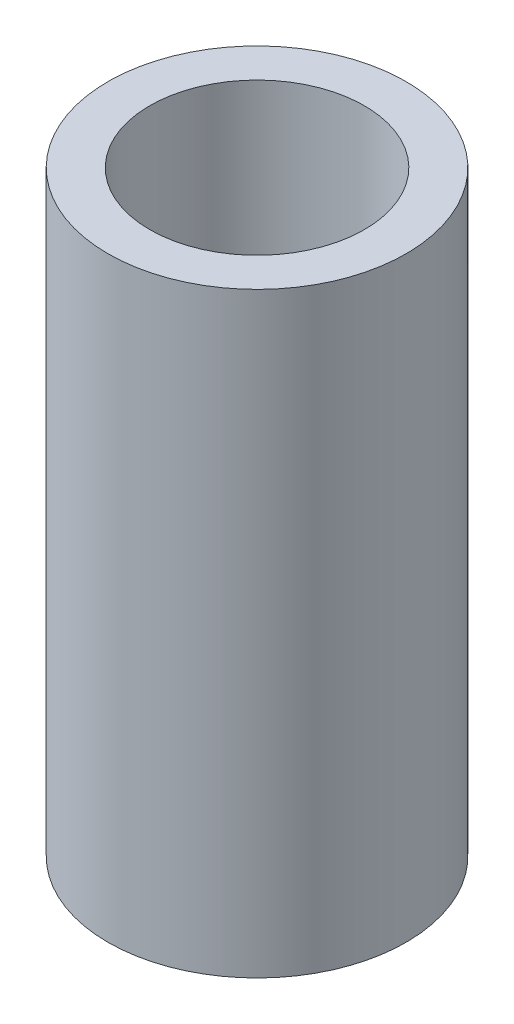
ISO-10303-21;
HEADER;
FILE_DESCRIPTION(('STEP AP214'),'2;1');
FILE_NAME('part.step','',(''),(''),'','','');
FILE_SCHEMA(('AUTOMOTIVE_DESIGN { 1 0 10303 214 1 1 1 1 }'));
ENDSEC;
DATA;
#1=APPLICATION_CONTEXT('core data for automotive mechanical design processes');
#2=APPLICATION_PROTOCOL_DEFINITION('international standard','automotive_design',2000,#1);
#3=PRODUCT_CONTEXT('',#1,'mechanical');
#4=PRODUCT('Part','Part','',(#3));
#5=PRODUCT_RELATED_PRODUCT_CATEGORY('part','',(#4));
#6=PRODUCT_DEFINITION_FORMATION('','',#4);
#7=PRODUCT_DEFINITION_CONTEXT('part definition',#1,'design');
#8=PRODUCT_DEFINITION('design','',#6,#7);
#9=PRODUCT_DEFINITION_SHAPE('','',#8);
#10=(LENGTH_UNIT() NAMED_UNIT(*) SI_UNIT(.MILLI.,.METRE.));
#11=(NAMED_UNIT(*) PLANE_ANGLE_UNIT() SI_UNIT($,.RADIAN.));
#12=(NAMED_UNIT(*) SI_UNIT($,.STERADIAN.) SOLID_ANGLE_UNIT());
#13=UNCERTAINTY_MEASURE_WITH_UNIT(LENGTH_MEASURE(1.E-05),#10,'distance_accuracy_value','');
#14=(GEOMETRIC_REPRESENTATION_CONTEXT(3) GLOBAL_UNCERTAINTY_ASSIGNED_CONTEXT((#13)) GLOBAL_UNIT_ASSIGNED_CONTEXT((#10,
#11,#12)) REPRESENTATION_CONTEXT('',''));
#15=CARTESIAN_POINT('',(0.,0.,0.));
#16=DIRECTION('',(0.,0.,1.));
#17=DIRECTION('',(1.,0.,0.));
#18=AXIS2_PLACEMENT_3D('',#15,#16,#17);
#19=CARTESIAN_POINT('',(0.,50.,0.));
#20=DIRECTION('',(0.,1.,0.));
#21=DIRECTION('',(0.,0.,1.));
#22=AXIS2_PLACEMENT_3D('',#19,#20,#21);
#23=PLANE('',#22);
#24=CARTESIAN_POINT('',(0.,50.,0.));
#25=DIRECTION('',(0.,1.,0.));
#26=DIRECTION('',(0.,0.,1.));
#27=AXIS2_PLACEMENT_3D('',#24,#25,#26);
#28=CIRCLE('',#27,12.5);
#29=CARTESIAN_POINT('',(0.,50.,12.5));
#30=VERTEX_POINT('',#29);
#31=EDGE_CURVE('E10',#30,#30,#28,.T.);
#32=ORIENTED_EDGE('',*,*,#31,.T.);
#33=EDGE_LOOP('',(#32));
#34=FACE_BOUND('',#33,.T.);
#35=CARTESIAN_POINT('',(0.,50.,0.));
#36=DIRECTION('',(0.,1.,0.));
#37=DIRECTION('',(0.,0.,1.));
#38=AXIS2_PLACEMENT_3D('',#35,#36,#37);
#39=CIRCLE('',#38,9.);
#40=CARTESIAN_POINT('',(0.,50.,9.));
#41=VERTEX_POINT('',#40);
#42=EDGE_CURVE('E50',#41,#41,#39,.T.);
#43=ORIENTED_EDGE('',*,*,#42,.F.);
#44=EDGE_LOOP('',(#43));
#45=FACE_BOUND('',#44,.T.);
#46=ADVANCED_FACE('F37',(#34,#45),#23,.T.);
#47=CARTESIAN_POINT('',(0.,0.,0.));
#48=DIRECTION('',(0.,1.,0.));
#49=DIRECTION('',(0.,0.,1.));
#50=AXIS2_PLACEMENT_3D('',#47,#48,#49);
#51=PLANE('',#50);
#52=CARTESIAN_POINT('',(0.,0.,0.));
#53=DIRECTION('',(0.,1.,0.));
#54=DIRECTION('',(0.,0.,1.));
#55=AXIS2_PLACEMENT_3D('',#52,#53,#54);
#56=CIRCLE('',#55,12.5);
#57=CARTESIAN_POINT('',(0.,0.,12.5));
#58=VERTEX_POINT('',#57);
#59=EDGE_CURVE('E41',#58,#58,#56,.T.);
#60=ORIENTED_EDGE('',*,*,#59,.F.);
#61=EDGE_LOOP('',(#60));
#62=FACE_BOUND('',#61,.T.);
#63=CARTESIAN_POINT('',(0.,0.,0.));
#64=DIRECTION('',(0.,1.,0.));
#65=DIRECTION('',(0.,0.,1.));
#66=AXIS2_PLACEMENT_3D('',#63,#64,#65);
#67=CIRCLE('',#66,9.);
#68=CARTESIAN_POINT('',(0.,0.,9.));
#69=VERTEX_POINT('',#68);
#70=EDGE_CURVE('E52',#69,#69,#67,.T.);
#71=ORIENTED_EDGE('',*,*,#70,.T.);
#72=EDGE_LOOP('',(#71));
#73=FACE_BOUND('',#72,.T.);
#74=ADVANCED_FACE('F64',(#62,#73),#51,.F.);
#75=CARTESIAN_POINT('',(0.,50.,0.));
#76=DIRECTION('',(0.,-1.,0.));
#77=DIRECTION('',(0.,0.,-1.));
#78=AXIS2_PLACEMENT_3D('',#75,#76,#77);
#79=CYLINDRICAL_SURFACE('',#78,12.5);
#80=ORIENTED_EDGE('',*,*,#31,.F.);
#81=EDGE_LOOP('',(#80));
#82=FACE_BOUND('',#81,.T.);
#83=ORIENTED_EDGE('',*,*,#59,.T.);
#84=EDGE_LOOP('',(#83));
#85=FACE_BOUND('',#84,.T.);
#86=ADVANCED_FACE('F39',(#82,#85),#79,.T.);
#87=CARTESIAN_POINT('',(0.,50.,0.));
#88=DIRECTION('',(0.,-1.,0.));
#89=DIRECTION('',(0.,0.,-1.));
#90=AXIS2_PLACEMENT_3D('',#87,#88,#89);
#91=CYLINDRICAL_SURFACE('',#90,9.);
#92=ORIENTED_EDGE('',*,*,#42,.T.);
#93=EDGE_LOOP('',(#92));
#94=FACE_BOUND('',#93,.T.);
#95=ORIENTED_EDGE('',*,*,#70,.F.);
#96=EDGE_LOOP('',(#95));
#97=FACE_BOUND('',#96,.T.);
#98=ADVANCED_FACE('F60',(#94,#97),#91,.F.);
#99=CLOSED_SHELL('',(#46,#74,#86,#98));
#100=MANIFOLD_SOLID_BREP('B2',#99);
#101=ADVANCED_BREP_SHAPE_REPRESENTATION('',(#18,#100),#14);
#102=SHAPE_DEFINITION_REPRESENTATION(#9,#101);
ENDSEC;
END-ISO-10303-21;
